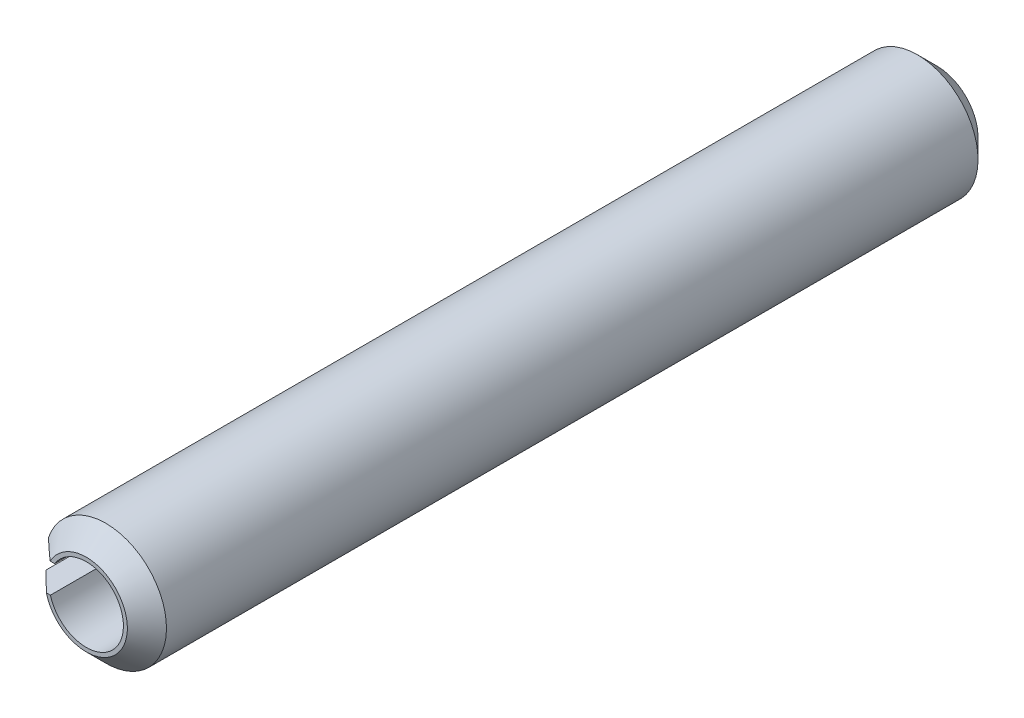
ISO-10303-21;
HEADER;
FILE_DESCRIPTION(('STEP AP214'),'2;1');
FILE_NAME('part.step','',(''),(''),'','','');
FILE_SCHEMA(('AUTOMOTIVE_DESIGN { 1 0 10303 214 1 1 1 1 }'));
ENDSEC;
DATA;
#1=APPLICATION_CONTEXT('core data for automotive mechanical design processes');
#2=APPLICATION_PROTOCOL_DEFINITION('international standard','automotive_design',2000,#1);
#3=PRODUCT_CONTEXT('',#1,'mechanical');
#4=PRODUCT('Part','Part','',(#3));
#5=PRODUCT_RELATED_PRODUCT_CATEGORY('part','',(#4));
#6=PRODUCT_DEFINITION_FORMATION('','',#4);
#7=PRODUCT_DEFINITION_CONTEXT('part definition',#1,'design');
#8=PRODUCT_DEFINITION('design','',#6,#7);
#9=PRODUCT_DEFINITION_SHAPE('','',#8);
#10=(LENGTH_UNIT() NAMED_UNIT(*) SI_UNIT(.MILLI.,.METRE.));
#11=(NAMED_UNIT(*) PLANE_ANGLE_UNIT() SI_UNIT($,.RADIAN.));
#12=(NAMED_UNIT(*) SI_UNIT($,.STERADIAN.) SOLID_ANGLE_UNIT());
#13=UNCERTAINTY_MEASURE_WITH_UNIT(LENGTH_MEASURE(1.E-05),#10,'distance_accuracy_value','');
#14=(GEOMETRIC_REPRESENTATION_CONTEXT(3) GLOBAL_UNCERTAINTY_ASSIGNED_CONTEXT((#13)) GLOBAL_UNIT_ASSIGNED_CONTEXT((#10,
#11,#12)) REPRESENTATION_CONTEXT('',''));
#15=CARTESIAN_POINT('',(0.,0.,0.));
#16=DIRECTION('',(0.,0.,1.));
#17=DIRECTION('',(1.,0.,0.));
#18=AXIS2_PLACEMENT_3D('',#15,#16,#17);
#19=CARTESIAN_POINT('',(0.,0.,5.5245));
#20=DIRECTION('',(0.,0.,-1.));
#21=DIRECTION('',(-1.,0.,0.));
#22=AXIS2_PLACEMENT_3D('',#19,#20,#21);
#23=CYLINDRICAL_SURFACE('',#22,0.7874);
#24=DIRECTION('',(0.,0.,-1.));
#25=VECTOR('',#24,1.);
#26=CARTESIAN_POINT('',(-0.77709057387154,-0.127,5.5245));
#27=LINE('',#26,#25);
#28=CARTESIAN_POINT('',(-0.77709057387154,-0.127,5.2705));
#29=VERTEX_POINT('',#28);
#30=CARTESIAN_POINT('',(-0.77709057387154,-0.127,-5.2705));
#31=VERTEX_POINT('',#30);
#32=EDGE_CURVE('E116',#29,#31,#27,.T.);
#33=ORIENTED_EDGE('',*,*,#32,.T.);
#34=CARTESIAN_POINT('',(0.,0.,-5.2705));
#35=DIRECTION('',(0.,0.,1.));
#36=DIRECTION('',(1.,0.,0.));
#37=AXIS2_PLACEMENT_3D('',#34,#35,#36);
#38=CIRCLE('',#37,0.7874);
#39=CARTESIAN_POINT('',(-0.745307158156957,0.254,-5.2705));
#40=VERTEX_POINT('',#39);
#41=EDGE_CURVE('E129',#31,#40,#38,.T.);
#42=ORIENTED_EDGE('',*,*,#41,.T.);
#43=DIRECTION('',(0.,0.,-1.));
#44=VECTOR('',#43,1.);
#45=CARTESIAN_POINT('',(-0.745307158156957,0.254,5.5245));
#46=LINE('',#45,#44);
#47=CARTESIAN_POINT('',(-0.745307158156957,0.254,5.2705));
#48=VERTEX_POINT('',#47);
#49=EDGE_CURVE('E109',#48,#40,#46,.T.);
#50=ORIENTED_EDGE('',*,*,#49,.F.);
#51=CARTESIAN_POINT('',(0.,0.,5.2705));
#52=DIRECTION('',(0.,0.,1.));
#53=DIRECTION('',(1.,0.,0.));
#54=AXIS2_PLACEMENT_3D('',#51,#52,#53);
#55=CIRCLE('',#54,0.7874);
#56=EDGE_CURVE('E127',#48,#29,#55,.F.);
#57=ORIENTED_EDGE('',*,*,#56,.T.);
#58=EDGE_LOOP('',(#33,#42,#50,#57));
#59=FACE_BOUND('',#58,.T.);
#60=ADVANCED_FACE('F35',(#59),#23,.T.);
#61=CARTESIAN_POINT('',(-0.410349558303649,0.254,5.5245));
#62=DIRECTION('',(0.,1.,0.));
#63=DIRECTION('',(-1.,0.,0.));
#64=AXIS2_PLACEMENT_3D('',#61,#62,#63);
#65=PLANE('',#64);
#66=ORIENTED_EDGE('',*,*,#49,.T.);
#67=CARTESIAN_POINT('',(-0.745307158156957,0.254,-5.2705));
#68=CARTESIAN_POINT('',(-0.722591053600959,0.254,-5.29199773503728));
#69=CARTESIAN_POINT('',(-0.699827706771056,0.254,-5.31344594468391));
#70=CARTESIAN_POINT('',(-0.654168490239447,0.254,-5.35619718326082));
#71=CARTESIAN_POINT('',(-0.631272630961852,0.254,-5.37750022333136));
#72=CARTESIAN_POINT('',(-0.585305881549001,0.254,-5.41991922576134));
#73=CARTESIAN_POINT('',(-0.562234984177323,0.254,-5.44103518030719));
#74=CARTESIAN_POINT('',(-0.515843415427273,0.254,-5.48299427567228));
#75=CARTESIAN_POINT('',(-0.49252272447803,0.254,-5.50383739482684));
#76=CARTESIAN_POINT('',(-0.469041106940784,0.254,-5.52450000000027));
#77=B_SPLINE_CURVE_WITH_KNOTS('',3,(#67,#68,#69,#70,#71,#72,#73,#74,#75,#76),.UNSPECIFIED.,.F.,
.F.,(4,2,2,2,4),(0.,0.0938276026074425,0.187647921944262,0.281472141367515,0.375303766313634),.UNSPECIFIED.);
#78=CARTESIAN_POINT('',(-0.46904110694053,0.254,-5.5245));
#79=VERTEX_POINT('',#78);
#80=EDGE_CURVE('E139',#40,#79,#77,.T.);
#81=ORIENTED_EDGE('',*,*,#80,.T.);
#82=DIRECTION('',(1.,0.,0.));
#83=VECTOR('',#82,1.);
#84=CARTESIAN_POINT('',(-0.410349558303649,0.254,-5.5245));
#85=LINE('',#84,#83);
#86=CARTESIAN_POINT('',(-0.410349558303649,0.254,-5.5245));
#87=VERTEX_POINT('',#86);
#88=EDGE_CURVE('E106',#79,#87,#85,.T.);
#89=ORIENTED_EDGE('',*,*,#88,.T.);
#90=DIRECTION('',(0.,0.,-1.));
#91=VECTOR('',#90,1.);
#92=CARTESIAN_POINT('',(-0.410349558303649,0.254,5.5245));
#93=LINE('',#92,#91);
#94=CARTESIAN_POINT('',(-0.410349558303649,0.254,5.5245));
#95=VERTEX_POINT('',#94);
#96=EDGE_CURVE('E103',#95,#87,#93,.T.);
#97=ORIENTED_EDGE('',*,*,#96,.F.);
#98=DIRECTION('',(1.,0.,0.));
#99=VECTOR('',#98,1.);
#100=CARTESIAN_POINT('',(-0.410349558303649,0.254,5.5245));
#101=LINE('',#100,#99);
#102=CARTESIAN_POINT('',(-0.469041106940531,0.254,5.5245));
#103=VERTEX_POINT('',#102);
#104=EDGE_CURVE('E92',#103,#95,#101,.T.);
#105=ORIENTED_EDGE('',*,*,#104,.F.);
#106=CARTESIAN_POINT('',(-0.469041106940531,0.254,5.5245));
#107=CARTESIAN_POINT('',(-0.492522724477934,0.254,5.50383739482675));
#108=CARTESIAN_POINT('',(-0.515843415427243,0.254,5.48299427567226));
#109=CARTESIAN_POINT('',(-0.562234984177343,0.254,5.44103518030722));
#110=CARTESIAN_POINT('',(-0.585305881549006,0.254,5.41991922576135));
#111=CARTESIAN_POINT('',(-0.631272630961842,0.254,5.37750022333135));
#112=CARTESIAN_POINT('',(-0.654168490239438,0.254,5.35619718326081));
#113=CARTESIAN_POINT('',(-0.69982770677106,0.254,5.31344594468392));
#114=CARTESIAN_POINT('',(-0.722591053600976,0.254,5.29199773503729));
#115=CARTESIAN_POINT('',(-0.745307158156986,0.254,5.27050000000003));
#116=B_SPLINE_CURVE_WITH_KNOTS('',3,(#106,#107,#108,#109,#110,#111,#112,#113,#114,#115),
.UNSPECIFIED.,.F.,.F.,(4,2,2,2,4),(0.,0.0938316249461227,0.18765584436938,0.281476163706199,
0.375303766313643),.UNSPECIFIED.);
#117=EDGE_CURVE('E132',#103,#48,#116,.T.);
#118=ORIENTED_EDGE('',*,*,#117,.T.);
#119=EDGE_LOOP('',(#66,#81,#89,#97,#105,#118));
#120=FACE_BOUND('',#119,.T.);
#121=ADVANCED_FACE('F105',(#120),#65,.F.);
#122=CARTESIAN_POINT('',(0.,0.,5.5245));
#123=DIRECTION('',(0.,0.,-1.));
#124=DIRECTION('',(-1.,0.,0.));
#125=AXIS2_PLACEMENT_3D('',#122,#123,#124);
#126=CYLINDRICAL_SURFACE('',#125,0.4826);
#127=CARTESIAN_POINT('',(0.,0.,-5.5245));
#128=DIRECTION('',(0.,0.,-1.));
#129=DIRECTION('',(1.,0.,0.));
#130=AXIS2_PLACEMENT_3D('',#127,#128,#129);
#131=CIRCLE('',#130,0.4826);
#132=CARTESIAN_POINT('',(-0.465589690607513,-0.127,-5.5245));
#133=VERTEX_POINT('',#132);
#134=EDGE_CURVE('E120',#87,#133,#131,.T.);
#135=ORIENTED_EDGE('',*,*,#134,.T.);
#136=DIRECTION('',(0.,0.,-1.));
#137=VECTOR('',#136,1.);
#138=CARTESIAN_POINT('',(-0.465589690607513,-0.127,5.5245));
#139=LINE('',#138,#137);
#140=CARTESIAN_POINT('',(-0.465589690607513,-0.127,5.5245));
#141=VERTEX_POINT('',#140);
#142=EDGE_CURVE('E110',#141,#133,#139,.T.);
#143=ORIENTED_EDGE('',*,*,#142,.F.);
#144=CARTESIAN_POINT('',(0.,0.,5.5245));
#145=DIRECTION('',(0.,0.,-1.));
#146=DIRECTION('',(1.,0.,0.));
#147=AXIS2_PLACEMENT_3D('',#144,#145,#146);
#148=CIRCLE('',#147,0.4826);
#149=EDGE_CURVE('E96',#95,#141,#148,.T.);
#150=ORIENTED_EDGE('',*,*,#149,.F.);
#151=ORIENTED_EDGE('',*,*,#96,.T.);
#152=EDGE_LOOP('',(#135,#143,#150,#151));
#153=FACE_BOUND('',#152,.T.);
#154=ADVANCED_FACE('F112',(#153),#126,.F.);
#155=CARTESIAN_POINT('',(-0.465589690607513,-0.127,5.5245));
#156=DIRECTION('',(0.,-1.,0.));
#157=DIRECTION('',(1.,0.,0.));
#158=AXIS2_PLACEMENT_3D('',#155,#156,#157);
#159=PLANE('',#158);
#160=DIRECTION('',(-1.,0.,0.));
#161=VECTOR('',#160,1.);
#162=CARTESIAN_POINT('',(-0.465589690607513,-0.127,-5.5245));
#163=LINE('',#162,#161);
#164=CARTESIAN_POINT('',(-0.518060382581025,-0.127,-5.5245));
#165=VERTEX_POINT('',#164);
#166=EDGE_CURVE('E100',#133,#165,#163,.T.);
#167=ORIENTED_EDGE('',*,*,#166,.T.);
#168=CARTESIAN_POINT('',(-0.518060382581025,-0.127,-5.5245));
#169=CARTESIAN_POINT('',(-0.539746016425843,-0.127,-5.50343528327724));
#170=CARTESIAN_POINT('',(-0.561396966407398,-0.127,-5.4823349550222));
#171=CARTESIAN_POINT('',(-0.604644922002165,-0.127,-5.4400792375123));
#172=CARTESIAN_POINT('',(-0.62624192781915,-0.127,-5.41892384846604));
#173=CARTESIAN_POINT('',(-0.66939753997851,-0.127,-5.37657405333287));
#174=CARTESIAN_POINT('',(-0.690956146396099,-0.127,-5.35537964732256));
#175=CARTESIAN_POINT('',(-0.734043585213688,-0.127,-5.31296042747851));
#176=CARTESIAN_POINT('',(-0.755572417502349,-0.127,-5.29173561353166));
#177=CARTESIAN_POINT('',(-0.77709057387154,-0.127,-5.2705));
#178=B_SPLINE_CURVE_WITH_KNOTS('',3,(#168,#169,#170,#171,#172,#173,#174,#175,#176,#177),
.UNSPECIFIED.,.F.,.F.,(4,2,2,2,4),(0.,0.0906966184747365,0.181392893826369,0.272088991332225,
0.362785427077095),.UNSPECIFIED.);
#179=EDGE_CURVE('E44',#165,#31,#178,.T.);
#180=ORIENTED_EDGE('',*,*,#179,.T.);
#181=ORIENTED_EDGE('',*,*,#32,.F.);
#182=CARTESIAN_POINT('',(-0.77709057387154,-0.127,5.2705));
#183=CARTESIAN_POINT('',(-0.75557241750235,-0.127,5.29173561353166));
#184=CARTESIAN_POINT('',(-0.734043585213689,-0.127,5.31296042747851));
#185=CARTESIAN_POINT('',(-0.6909561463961,-0.127,5.35537964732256));
#186=CARTESIAN_POINT('',(-0.66939753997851,-0.127,5.37657405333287));
#187=CARTESIAN_POINT('',(-0.62624192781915,-0.127,5.41892384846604));
#188=CARTESIAN_POINT('',(-0.604644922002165,-0.127,5.4400792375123));
#189=CARTESIAN_POINT('',(-0.561396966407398,-0.127,5.4823349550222));
#190=CARTESIAN_POINT('',(-0.539746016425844,-0.127,5.50343528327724));
#191=CARTESIAN_POINT('',(-0.518060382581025,-0.127,5.5245));
#192=B_SPLINE_CURVE_WITH_KNOTS('',3,(#182,#183,#184,#185,#186,#187,#188,#189,#190,#191),
.UNSPECIFIED.,.F.,.F.,(4,2,2,2,4),(0.,0.0906964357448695,0.181392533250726,0.272088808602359,
0.362785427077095),.UNSPECIFIED.);
#193=CARTESIAN_POINT('',(-0.518060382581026,-0.127,5.5245));
#194=VERTEX_POINT('',#193);
#195=EDGE_CURVE('E51',#29,#194,#192,.T.);
#196=ORIENTED_EDGE('',*,*,#195,.T.);
#197=DIRECTION('',(-1.,0.,0.));
#198=VECTOR('',#197,1.);
#199=CARTESIAN_POINT('',(-0.465589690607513,-0.127,5.5245));
#200=LINE('',#199,#198);
#201=EDGE_CURVE('E114',#141,#194,#200,.T.);
#202=ORIENTED_EDGE('',*,*,#201,.F.);
#203=ORIENTED_EDGE('',*,*,#142,.T.);
#204=EDGE_LOOP('',(#167,#180,#181,#196,#202,#203));
#205=FACE_BOUND('',#204,.T.);
#206=ADVANCED_FACE('F168',(#205),#159,.F.);
#207=CARTESIAN_POINT('',(0.,0.,5.5245));
#208=DIRECTION('',(0.,0.,1.));
#209=DIRECTION('',(1.,0.,0.));
#210=AXIS2_PLACEMENT_3D('',#207,#208,#209);
#211=PLANE('',#210);
#212=ORIENTED_EDGE('',*,*,#201,.T.);
#213=CARTESIAN_POINT('',(0.,0.,5.5245));
#214=DIRECTION('',(0.,0.,1.));
#215=DIRECTION('',(1.,0.,0.));
#216=AXIS2_PLACEMENT_3D('',#213,#214,#215);
#217=CIRCLE('',#216,0.533399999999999);
#218=EDGE_CURVE('E11',#194,#103,#217,.T.);
#219=ORIENTED_EDGE('',*,*,#218,.T.);
#220=ORIENTED_EDGE('',*,*,#104,.T.);
#221=ORIENTED_EDGE('',*,*,#149,.T.);
#222=EDGE_LOOP('',(#212,#219,#220,#221));
#223=FACE_BOUND('',#222,.T.);
#224=ADVANCED_FACE('F94',(#223),#211,.T.);
#225=CARTESIAN_POINT('',(0.,0.,-5.5245));
#226=DIRECTION('',(0.,0.,1.));
#227=DIRECTION('',(1.,0.,0.));
#228=AXIS2_PLACEMENT_3D('',#225,#226,#227);
#229=PLANE('',#228);
#230=ORIENTED_EDGE('',*,*,#88,.F.);
#231=CARTESIAN_POINT('',(0.,0.,-5.5245));
#232=DIRECTION('',(0.,0.,1.));
#233=DIRECTION('',(1.,0.,0.));
#234=AXIS2_PLACEMENT_3D('',#231,#232,#233);
#235=CIRCLE('',#234,0.533399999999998);
#236=EDGE_CURVE('E59',#79,#165,#235,.F.);
#237=ORIENTED_EDGE('',*,*,#236,.T.);
#238=ORIENTED_EDGE('',*,*,#166,.F.);
#239=ORIENTED_EDGE('',*,*,#134,.F.);
#240=EDGE_LOOP('',(#230,#237,#238,#239));
#241=FACE_BOUND('',#240,.T.);
#242=ADVANCED_FACE('F156',(#241),#229,.F.);
#243=CARTESIAN_POINT('',(0.,0.,-5.2705));
#244=DIRECTION('',(0.,0.,1.));
#245=DIRECTION('',(1.,0.,0.));
#246=AXIS2_PLACEMENT_3D('',#243,#244,#245);
#247=CONICAL_SURFACE('',#246,0.7874,0.78539816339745);
#248=ORIENTED_EDGE('',*,*,#179,.F.);
#249=ORIENTED_EDGE('',*,*,#236,.F.);
#250=ORIENTED_EDGE('',*,*,#80,.F.);
#251=ORIENTED_EDGE('',*,*,#41,.F.);
#252=EDGE_LOOP('',(#248,#249,#250,#251));
#253=FACE_BOUND('',#252,.T.);
#254=ADVANCED_FACE('F153',(#253),#247,.T.);
#255=CARTESIAN_POINT('',(0.,0.,5.5245));
#256=DIRECTION('',(0.,0.,-1.));
#257=DIRECTION('',(-1.,0.,0.));
#258=AXIS2_PLACEMENT_3D('',#255,#256,#257);
#259=CONICAL_SURFACE('',#258,0.533399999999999,0.785398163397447);
#260=ORIENTED_EDGE('',*,*,#195,.F.);
#261=ORIENTED_EDGE('',*,*,#56,.F.);
#262=ORIENTED_EDGE('',*,*,#117,.F.);
#263=ORIENTED_EDGE('',*,*,#218,.F.);
#264=EDGE_LOOP('',(#260,#261,#262,#263));
#265=FACE_BOUND('',#264,.T.);
#266=ADVANCED_FACE('F37',(#265),#259,.T.);
#267=CLOSED_SHELL('',(#60,#121,#154,#206,#224,#242,#254,#266));
#268=MANIFOLD_SOLID_BREP('B2',#267);
#269=ADVANCED_BREP_SHAPE_REPRESENTATION('',(#18,#268),#14);
#270=SHAPE_DEFINITION_REPRESENTATION(#9,#269);
ENDSEC;
END-ISO-10303-21;
